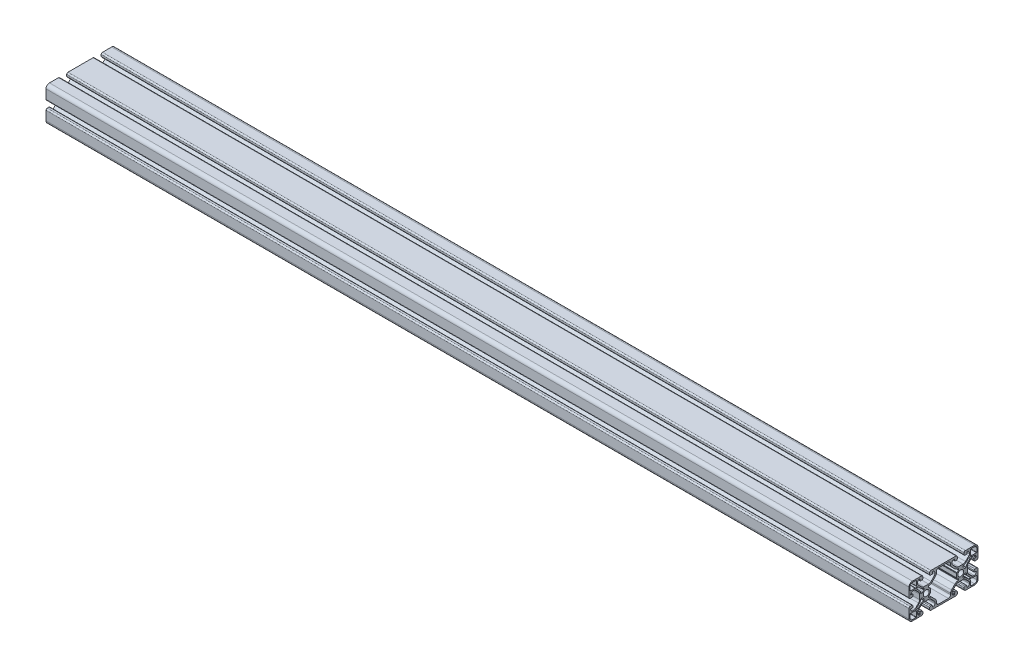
from build123d import *

# Parameters (mm, degrees)
MODEL_R                = 3.4
STRUKTURBAUTEIL1_DEPTH = 1000


with BuildPart() as part:
    # Model → Strukturbauteil1 (new body)
    with BuildSketch(Plane(origin=(0, 0, 0), x_dir=(0, 0, -1), z_dir=(1, 0, 0))):
        with BuildLine():
            Line((-40, -16), (-40, -5.5))
            ThreePointArc((-40, -5.5), (-39.560660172, -4.439339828), (-38.5, -4))
            Line((-38.5, -4), (-36.5, -4))
            ThreePointArc((-36.5, -4), (-35.792893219, -4.292893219), (-35.5, -5))
            Line((-35.5, -5), (-35.5, -6.5))
            ThreePointArc((-35.5, -6.5), (-35.646446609, -6.853553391), (-36, -7))
            Line((-36, -7), (-37.5, -7))
            Line((-37.5, -7), (-37.691341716, -7.038060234))
            Line((-37.691341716, -7.038060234), (-37.853553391, -7.146446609))
            Line((-37.853553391, -7.146446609), (-37.961939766, -7.308658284))
            Line((-37.961939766, -7.308658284), (-38, -7.5))
            ThreePointArc((-38, -7.5), (-37.267766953, -9.267766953), (-35.5, -10))
            Line((-35.5, -10), (-34.222539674, -10))
            ThreePointArc((-34.222539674, -10), (-33.45717281, -9.847759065), (-32.808326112, -9.414213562))
            Line((-32.808326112, -9.414213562), (-28.921572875, -5.527460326))
            ThreePointArc((-28.921572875, -5.527460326), (-28.05448187, -4.22976693), (-27.75, -2.699033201))
            Line((-27.75, -2.699033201), (-27.75, 2.699033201))
            ThreePointArc((-27.75, 2.699033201), (-28.05448187, 4.22976693), (-28.921572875, 5.527460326))
            Line((-28.921572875, 5.527460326), (-32.808326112, 9.414213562))
            ThreePointArc((-32.808326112, 9.414213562), (-33.45717281, 9.847759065), (-34.222539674, 10))
            Line((-34.222539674, 10), (-35.5, 10))
            ThreePointArc((-35.5, 10), (-37.267766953, 9.267766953), (-38, 7.5))
            Line((-38, 7.5), (-37.961939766, 7.308658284))
            Line((-37.961939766, 7.308658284), (-37.853553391, 7.146446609))
            Line((-37.853553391, 7.146446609), (-37.691341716, 7.038060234))
            Line((-37.691341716, 7.038060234), (-37.5, 7))
            Line((-37.5, 7), (-36, 7))
            ThreePointArc((-36, 7), (-35.646446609, 6.853553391), (-35.5, 6.5))
            Line((-35.5, 6.5), (-35.5, 5))
            ThreePointArc((-35.5, 5), (-35.792893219, 4.292893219), (-36.5, 4))
            Line((-36.5, 4), (-38.5, 4))
            ThreePointArc((-38.5, 4), (-39.560660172, 4.439339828), (-40, 5.5))
            Line((-40, 5.5), (-40, 16))
            ThreePointArc((-40, 16), (-38.828427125, 18.828427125), (-36, 20))
            Line((-36, 20), (-25.5, 20))
            ThreePointArc((-25.5, 20), (-24.439339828, 19.560660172), (-24, 18.5))
            Line((-24, 18.5), (-24, 16.5))
            ThreePointArc((-24, 16.5), (-24.292893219, 15.792893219), (-25, 15.5))
            Line((-25, 15.5), (-26.5, 15.5))
            ThreePointArc((-26.5, 15.5), (-26.853553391, 15.646446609), (-27, 16))
            Line((-27, 16), (-27, 17.5))
            Line((-27, 17.5), (-27.038060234, 17.691341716))
            Line((-27.038060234, 17.691341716), (-27.146446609, 17.853553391))
            Line((-27.146446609, 17.853553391), (-27.308658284, 17.961939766))
            Line((-27.308658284, 17.961939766), (-27.5, 18))
            ThreePointArc((-27.5, 18), (-29.267766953, 17.267766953), (-30, 15.5))
            Line((-30, 15.5), (-30, 14.222539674))
            ThreePointArc((-30, 14.222539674), (-29.847759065, 13.45717281), (-29.414213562, 12.808326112))
            Line((-29.414213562, 12.808326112), (-25.527460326, 8.921572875))
            ThreePointArc((-25.527460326, 8.921572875), (-24.22976693, 8.05448187), (-22.699033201, 7.75))
            Line((-22.699033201, 7.75), (-17.300966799, 7.75))
            ThreePointArc((-17.300966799, 7.75), (-15.77023307, 8.05448187), (-14.472539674, 8.921572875))
            Line((-14.472539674, 8.921572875), (-10.585786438, 12.808326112))
            ThreePointArc((-10.585786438, 12.808326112), (-10.152240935, 13.45717281), (-10, 14.222539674))
            Line((-10, 14.222539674), (-10, 15.5))
            ThreePointArc((-10, 15.5), (-10.732233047, 17.267766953), (-12.5, 18))
            Line((-12.5, 18), (-12.691341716, 17.961939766))
            Line((-12.691341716, 17.961939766), (-12.853553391, 17.853553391))
            Line((-12.853553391, 17.853553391), (-12.961939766, 17.691341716))
            Line((-12.961939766, 17.691341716), (-13, 17.5))
            Line((-13, 17.5), (-13, 16))
            ThreePointArc((-13, 16), (-13.146446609, 15.646446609), (-13.5, 15.5))
            Line((-13.5, 15.5), (-15, 15.5))
            ThreePointArc((-15, 15.5), (-15.707106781, 15.792893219), (-16, 16.5))
            Line((-16, 16.5), (-16, 18.5))
            ThreePointArc((-16, 18.5), (-15.560660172, 19.560660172), (-14.5, 20))
            Line((-14.5, 20), (14.5, 20))
            ThreePointArc((14.5, 20), (15.560660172, 19.560660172), (16, 18.5))
            Line((16, 18.5), (16, 16.5))
            ThreePointArc((16, 16.5), (15.707106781, 15.792893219), (15, 15.5))
            Line((15, 15.5), (13.5, 15.5))
            ThreePointArc((13.5, 15.5), (13.146446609, 15.646446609), (13, 16))
            Line((13, 16), (13, 17.5))
            Line((13, 17.5), (12.961939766, 17.691341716))
            Line((12.961939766, 17.691341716), (12.853553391, 17.853553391))
            Line((12.853553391, 17.853553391), (12.691341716, 17.961939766))
            Line((12.691341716, 17.961939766), (12.5, 18))
            ThreePointArc((12.5, 18), (10.732233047, 17.267766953), (10, 15.5))
            Line((10, 15.5), (10, 14.222539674))
            ThreePointArc((10, 14.222539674), (10.152240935, 13.45717281), (10.585786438, 12.808326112))
            Line((10.585786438, 12.808326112), (14.472539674, 8.921572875))
            ThreePointArc((14.472539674, 8.921572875), (15.77023307, 8.05448187), (17.300966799, 7.75))
            Line((17.300966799, 7.75), (22.699033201, 7.75))
            ThreePointArc((22.699033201, 7.75), (24.22976693, 8.05448187), (25.527460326, 8.921572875))
            Line((25.527460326, 8.921572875), (29.414213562, 12.808326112))
            ThreePointArc((29.414213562, 12.808326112), (29.847759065, 13.45717281), (30, 14.222539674))
            Line((30, 14.222539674), (30, 15.5))
            ThreePointArc((30, 15.5), (29.267766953, 17.267766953), (27.5, 18))
            Line((27.5, 18), (27.308658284, 17.961939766))
            Line((27.308658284, 17.961939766), (27.146446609, 17.853553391))
            Line((27.146446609, 17.853553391), (27.038060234, 17.691341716))
            Line((27.038060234, 17.691341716), (27, 17.5))
            Line((27, 17.5), (27, 16))
            ThreePointArc((27, 16), (26.853553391, 15.646446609), (26.5, 15.5))
            Line((26.5, 15.5), (25, 15.5))
            ThreePointArc((25, 15.5), (24.292893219, 15.792893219), (24, 16.5))
            Line((24, 16.5), (24, 18.5))
            ThreePointArc((24, 18.5), (24.439339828, 19.560660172), (25.5, 20))
            Line((25.5, 20), (36, 20))
            ThreePointArc((36, 20), (38.828427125, 18.828427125), (40, 16))
            Line((40, 16), (40, 5.5))
            ThreePointArc((40, 5.5), (39.560660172, 4.439339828), (38.5, 4))
            Line((38.5, 4), (36.5, 4))
            ThreePointArc((36.5, 4), (35.792893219, 4.292893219), (35.5, 5))
            Line((35.5, 5), (35.5, 6.5))
            ThreePointArc((35.5, 6.5), (35.646446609, 6.853553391), (36, 7))
            Line((36, 7), (37.5, 7))
            Line((37.5, 7), (37.691341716, 7.038060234))
            Line((37.691341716, 7.038060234), (37.853553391, 7.146446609))
            Line((37.853553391, 7.146446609), (37.961939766, 7.308658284))
            Line((37.961939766, 7.308658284), (38, 7.5))
            ThreePointArc((38, 7.5), (37.267766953, 9.267766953), (35.5, 10))
            Line((35.5, 10), (34.222539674, 10))
            ThreePointArc((34.222539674, 10), (33.45717281, 9.847759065), (32.808326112, 9.414213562))
            Line((32.808326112, 9.414213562), (28.921572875, 5.527460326))
            ThreePointArc((28.921572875, 5.527460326), (28.05448187, 4.22976693), (27.75, 2.699033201))
            Line((27.75, 2.699033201), (27.75, -2.699033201))
            ThreePointArc((27.75, -2.699033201), (28.05448187, -4.22976693), (28.921572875, -5.527460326))
            Line((28.921572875, -5.527460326), (32.808326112, -9.414213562))
            ThreePointArc((32.808326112, -9.414213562), (33.45717281, -9.847759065), (34.222539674, -10))
            Line((34.222539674, -10), (35.5, -10))
            ThreePointArc((35.5, -10), (37.267766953, -9.267766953), (38, -7.5))
            Line((38, -7.5), (37.961939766, -7.308658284))
            Line((37.961939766, -7.308658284), (37.853553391, -7.146446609))
            Line((37.853553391, -7.146446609), (37.691341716, -7.038060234))
            Line((37.691341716, -7.038060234), (37.5, -7))
            Line((37.5, -7), (36, -7))
            ThreePointArc((36, -7), (35.646446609, -6.853553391), (35.5, -6.5))
            Line((35.5, -6.5), (35.5, -5))
            ThreePointArc((35.5, -5), (35.792893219, -4.292893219), (36.5, -4))
            Line((36.5, -4), (38.5, -4))
            ThreePointArc((38.5, -4), (39.560660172, -4.439339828), (40, -5.5))
            Line((40, -5.5), (40, -16))
            ThreePointArc((40, -16), (38.828427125, -18.828427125), (36, -20))
            Line((36, -20), (25.5, -20))
            ThreePointArc((25.5, -20), (24.439339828, -19.560660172), (24, -18.5))
            Line((24, -18.5), (24, -16.5))
            ThreePointArc((24, -16.5), (24.292893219, -15.792893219), (25, -15.5))
            Line((25, -15.5), (26.5, -15.5))
            ThreePointArc((26.5, -15.5), (26.853553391, -15.646446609), (27, -16))
            Line((27, -16), (27, -17.5))
            Line((27, -17.5), (27.038060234, -17.691341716))
            Line((27.038060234, -17.691341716), (27.146446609, -17.853553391))
            Line((27.146446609, -17.853553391), (27.308658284, -17.961939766))
            Line((27.308658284, -17.961939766), (27.5, -18))
            ThreePointArc((27.5, -18), (29.267766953, -17.267766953), (30, -15.5))
            Line((30, -15.5), (30, -14.222539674))
            ThreePointArc((30, -14.222539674), (29.847759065, -13.45717281), (29.414213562, -12.808326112))
            Line((29.414213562, -12.808326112), (25.527460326, -8.921572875))
            ThreePointArc((25.527460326, -8.921572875), (24.22976693, -8.05448187), (22.699033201, -7.75))
            Line((22.699033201, -7.75), (17.300966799, -7.75))
            ThreePointArc((17.300966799, -7.75), (15.77023307, -8.05448187), (14.472539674, -8.921572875))
            Line((14.472539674, -8.921572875), (10.585786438, -12.808326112))
            ThreePointArc((10.585786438, -12.808326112), (10.152240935, -13.45717281), (10, -14.222539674))
            Line((10, -14.222539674), (10, -15.5))
            ThreePointArc((10, -15.5), (10.732233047, -17.267766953), (12.5, -18))
            Line((12.5, -18), (12.691341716, -17.961939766))
            Line((12.691341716, -17.961939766), (12.853553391, -17.853553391))
            Line((12.853553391, -17.853553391), (12.961939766, -17.691341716))
            Line((12.961939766, -17.691341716), (13, -17.5))
            Line((13, -17.5), (13, -16))
            ThreePointArc((13, -16), (13.146446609, -15.646446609), (13.5, -15.5))
            Line((13.5, -15.5), (15, -15.5))
            ThreePointArc((15, -15.5), (15.707106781, -15.792893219), (16, -16.5))
            Line((16, -16.5), (16, -18.5))
            ThreePointArc((16, -18.5), (15.560660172, -19.560660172), (14.5, -20))
            Line((14.5, -20), (-14.5, -20))
            ThreePointArc((-14.5, -20), (-15.560660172, -19.560660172), (-16, -18.5))
            Line((-16, -18.5), (-16, -16.5))
            ThreePointArc((-16, -16.5), (-15.707106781, -15.792893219), (-15, -15.5))
            Line((-15, -15.5), (-13.5, -15.5))
            ThreePointArc((-13.5, -15.5), (-13.146446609, -15.646446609), (-13, -16))
            Line((-13, -16), (-13, -17.5))
            Line((-13, -17.5), (-12.961939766, -17.691341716))
            Line((-12.961939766, -17.691341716), (-12.853553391, -17.853553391))
            Line((-12.853553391, -17.853553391), (-12.691341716, -17.961939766))
            Line((-12.691341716, -17.961939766), (-12.5, -18))
            ThreePointArc((-12.5, -18), (-10.732233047, -17.267766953), (-10, -15.5))
            Line((-10, -15.5), (-10, -14.222539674))
            ThreePointArc((-10, -14.222539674), (-10.152240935, -13.45717281), (-10.585786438, -12.808326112))
            Line((-10.585786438, -12.808326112), (-14.472539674, -8.921572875))
            ThreePointArc((-14.472539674, -8.921572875), (-15.77023307, -8.05448187), (-17.300966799, -7.75))
            Line((-17.300966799, -7.75), (-22.699033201, -7.75))
            ThreePointArc((-22.699033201, -7.75), (-24.22976693, -8.05448187), (-25.527460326, -8.921572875))
            Line((-25.527460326, -8.921572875), (-29.414213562, -12.808326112))
            ThreePointArc((-29.414213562, -12.808326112), (-29.847759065, -13.45717281), (-30, -14.222539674))
            Line((-30, -14.222539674), (-30, -15.5))
            ThreePointArc((-30, -15.5), (-29.267766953, -17.267766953), (-27.5, -18))
            Line((-27.5, -18), (-27.308658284, -17.961939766))
            Line((-27.308658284, -17.961939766), (-27.146446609, -17.853553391))
            Line((-27.146446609, -17.853553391), (-27.038060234, -17.691341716))
            Line((-27.038060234, -17.691341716), (-27, -17.5))
            Line((-27, -17.5), (-27, -16))
            ThreePointArc((-27, -16), (-26.853553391, -15.646446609), (-26.5, -15.5))
            Line((-26.5, -15.5), (-25, -15.5))
            ThreePointArc((-25, -15.5), (-24.292893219, -15.792893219), (-24, -16.5))
            Line((-24, -16.5), (-24, -18.5))
            ThreePointArc((-24, -18.5), (-24.439339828, -19.560660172), (-25.5, -20))
            Line((-25.5, -20), (-36, -20))
            ThreePointArc((-36, -20), (-38.828427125, -18.828427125), (-40, -16))
        make_face()
        with Locations((-20, 0)):
            Circle(MODEL_R, mode=Mode.SUBTRACT)
        with Locations((20, 0)):
            Circle(MODEL_R, mode=Mode.SUBTRACT)
        with BuildLine():
            Line((-30.748023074, 9.333809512), (-27.931623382, 6.517409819))
            ThreePointArc((-27.931623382, 6.517409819), (-26.779549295, 4.809630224), (-26.350847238, 2.794685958))
            Line((-26.350847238, 2.794685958), (-26.326508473, 2.681522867))
            Line((-26.326508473, 2.681522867), (-26.261139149, 2.585997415))
            Line((-26.261139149, 2.585997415), (-26.164470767, 2.522330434))
            Line((-26.164470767, 2.522330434), (-26.050894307, 2.5))
            Line((-26.050894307, 2.5), (-24.5, 2.5))
            ThreePointArc((-24.5, 2.5), (-24.354307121, 2.537752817), (-24.245283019, 2.641509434))
            Line((-24.245283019, 2.641509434), (-23.535533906, 3.535533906))
            Line((-23.535533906, 3.535533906), (-22.641509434, 4.245283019))
            ThreePointArc((-22.641509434, 4.245283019), (-22.537752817, 4.354307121), (-22.5, 4.5))
            Line((-22.5, 4.5), (-22.5, 6.050894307))
            Line((-22.5, 6.050894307), (-22.522330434, 6.164470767))
            Line((-22.522330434, 6.164470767), (-22.585997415, 6.261139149))
            Line((-22.585997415, 6.261139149), (-22.681522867, 6.326508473))
            Line((-22.681522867, 6.326508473), (-22.794685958, 6.350847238))
            ThreePointArc((-22.794685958, 6.350847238), (-24.809630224, 6.779549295), (-26.517409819, 7.931623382))
            Line((-26.517409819, 7.931623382), (-29.333809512, 10.748023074))
            ThreePointArc((-29.333809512, 10.748023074), (-29.545941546, 10.83589104), (-29.75807358, 10.748023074))
            Line((-29.75807358, 10.748023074), (-30.748023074, 9.75807358))
            ThreePointArc((-30.748023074, 9.75807358), (-30.83589104, 9.545941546), (-30.748023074, 9.333809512))
        make_face(mode=Mode.SUBTRACT)
        with BuildLine():
            Line((-31.4, 12.938477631), (-31.4, 18.3))
            ThreePointArc((-31.4, 18.3), (-31.487867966, 18.512132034), (-31.7, 18.6))
            Line((-31.7, 18.6), (-36, 18.6))
            ThreePointArc((-36, 18.6), (-37.838477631, 17.838477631), (-38.6, 16))
            Line((-38.6, 16), (-38.6, 11.7))
            ThreePointArc((-38.6, 11.7), (-38.512132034, 11.487867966), (-38.3, 11.4))
            Line((-38.3, 11.4), (-32.938477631, 11.4))
            ThreePointArc((-32.938477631, 11.4), (-32.823672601, 11.37716386), (-32.726345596, 11.312132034))
            Line((-32.726345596, 11.312132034), (-32.162236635, 10.748023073))
            ThreePointArc((-32.162236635, 10.748023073), (-31.950104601, 10.660155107), (-31.737972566, 10.748023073))
            Line((-31.737972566, 10.748023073), (-30.748023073, 11.737972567))
            ThreePointArc((-30.748023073, 11.737972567), (-30.660155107, 11.950104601), (-30.748023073, 12.162236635))
            Line((-30.748023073, 12.162236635), (-31.312132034, 12.726345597))
            ThreePointArc((-31.312132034, 12.726345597), (-31.37716386, 12.823672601), (-31.4, 12.938477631))
        make_face(mode=Mode.SUBTRACT)
        with BuildLine():
            Line((-8.2, -15.7), (-8.2, -14.222539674))
            ThreePointArc((-8.2, -14.222539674), (-8.489257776, -12.768342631), (-9.312994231, -11.535533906))
            Line((-9.312994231, -11.535533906), (-13.199747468, -7.648780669))
            ThreePointArc((-13.199747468, -7.648780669), (-15.037130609, -6.410051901), (-17.20496558, -5.950794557))
            Line((-17.20496558, -5.950794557), (-17.31823695, -5.926552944))
            Line((-17.31823695, -5.926552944), (-17.413880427, -5.861204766))
            Line((-17.413880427, -5.861204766), (-17.477636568, -5.764492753))
            Line((-17.477636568, -5.764492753), (-17.5, -5.650835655))
            Line((-17.5, -5.650835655), (-17.5, -4.5))
            ThreePointArc((-17.5, -4.5), (-17.462247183, -4.354307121), (-17.358490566, -4.245283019))
            Line((-17.358490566, -4.245283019), (-16.464466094, -3.535533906))
            Line((-16.464466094, -3.535533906), (-15.754716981, -2.641509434))
            ThreePointArc((-15.754716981, -2.641509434), (-15.645692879, -2.537752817), (-15.5, -2.5))
            Line((-15.5, -2.5), (-15.3, -2.5))
            ThreePointArc((-15.3, -2.5), (-15.087867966, -2.412132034), (-15, -2.2))
            Line((-15, -2.2), (-15, 2.2))
            ThreePointArc((-15, 2.2), (-15.087867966, 2.412132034), (-15.3, 2.5))
            Line((-15.3, 2.5), (-15.5, 2.5))
            ThreePointArc((-15.5, 2.5), (-15.645692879, 2.537752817), (-15.754716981, 2.641509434))
            Line((-15.754716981, 2.641509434), (-16.464466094, 3.535533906))
            Line((-16.464466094, 3.535533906), (-17.358490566, 4.245283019))
            ThreePointArc((-17.358490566, 4.245283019), (-17.462247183, 4.354307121), (-17.5, 4.5))
            Line((-17.5, 4.5), (-17.5, 5.650835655))
            Line((-17.5, 5.650835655), (-17.477636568, 5.764492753))
            Line((-17.477636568, 5.764492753), (-17.413880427, 5.861204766))
            Line((-17.413880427, 5.861204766), (-17.31823695, 5.926552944))
            Line((-17.31823695, 5.926552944), (-17.20496558, 5.950794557))
            ThreePointArc((-17.20496558, 5.950794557), (-15.037130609, 6.410051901), (-13.199747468, 7.648780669))
            Line((-13.199747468, 7.648780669), (-9.312994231, 11.535533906))
            ThreePointArc((-9.312994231, 11.535533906), (-8.489257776, 12.768342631), (-8.2, 14.222539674))
            Line((-8.2, 14.222539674), (-8.2, 15.7))
            ThreePointArc((-8.2, 15.7), (-7.467766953, 17.467766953), (-5.7, 18.2))
            Line((-5.7, 18.2), (5.7, 18.2))
            ThreePointArc((5.7, 18.2), (7.467766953, 17.467766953), (8.2, 15.7))
            Line((8.2, 15.7), (8.2, 14.222539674))
            ThreePointArc((8.2, 14.222539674), (8.489257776, 12.768342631), (9.312994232, 11.535533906))
            Line((9.312994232, 11.535533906), (13.199747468, 7.648780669))
            ThreePointArc((13.199747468, 7.648780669), (15.037130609, 6.410051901), (17.20496558, 5.950794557))
            Line((17.20496558, 5.950794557), (17.31823695, 5.926552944))
            Line((17.31823695, 5.926552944), (17.413880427, 5.861204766))
            Line((17.413880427, 5.861204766), (17.477636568, 5.764492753))
            Line((17.477636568, 5.764492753), (17.5, 5.650835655))
            Line((17.5, 5.650835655), (17.5, 4.5))
            ThreePointArc((17.5, 4.5), (17.462247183, 4.354307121), (17.358490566, 4.245283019))
            ThreePointArc((17.358490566, 4.245283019), (16.464466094, 3.535533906), (15.754716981, 2.641509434))
            ThreePointArc((15.754716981, 2.641509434), (15.645692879, 2.537752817), (15.5, 2.5))
            Line((15.5, 2.5), (15.3, 2.5))
            ThreePointArc((15.3, 2.5), (15.087867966, 2.412132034), (15, 2.2))
            Line((15, 2.2), (15, -2.2))
            ThreePointArc((15, -2.2), (15.087867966, -2.412132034), (15.3, -2.5))
            Line((15.3, -2.5), (15.5, -2.5))
            ThreePointArc((15.5, -2.5), (15.645692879, -2.537752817), (15.754716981, -2.641509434))
            ThreePointArc((15.754716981, -2.641509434), (16.464466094, -3.535533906), (17.358490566, -4.245283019))
            ThreePointArc((17.358490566, -4.245283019), (17.462247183, -4.354307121), (17.5, -4.5))
            Line((17.5, -4.5), (17.5, -5.650835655))
            Line((17.5, -5.650835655), (17.477636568, -5.764492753))
            Line((17.477636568, -5.764492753), (17.413880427, -5.861204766))
            Line((17.413880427, -5.861204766), (17.31823695, -5.926552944))
            Line((17.31823695, -5.926552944), (17.20496558, -5.950794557))
            ThreePointArc((17.20496558, -5.950794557), (15.037130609, -6.410051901), (13.199747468, -7.648780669))
            Line((13.199747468, -7.648780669), (9.312994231, -11.535533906))
            ThreePointArc((9.312994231, -11.535533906), (8.489257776, -12.768342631), (8.2, -14.222539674))
            Line((8.2, -14.222539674), (8.2, -15.7))
            ThreePointArc((8.2, -15.7), (7.467766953, -17.467766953), (5.7, -18.2))
            Line((5.7, -18.2), (-5.7, -18.2))
            ThreePointArc((-5.7, -18.2), (-7.467766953, -17.467766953), (-8.2, -15.7))
        make_face(mode=Mode.SUBTRACT)
        with BuildLine():
            Line((-22.5, -6.050894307), (-22.5, -4.5))
            ThreePointArc((-22.5, -4.5), (-22.537752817, -4.354307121), (-22.641509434, -4.245283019))
            Line((-22.641509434, -4.245283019), (-23.535533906, -3.535533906))
            Line((-23.535533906, -3.535533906), (-24.245283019, -2.641509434))
            ThreePointArc((-24.245283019, -2.641509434), (-24.354307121, -2.537752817), (-24.5, -2.5))
            Line((-24.5, -2.5), (-26.050894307, -2.5))
            Line((-26.050894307, -2.5), (-26.164470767, -2.522330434))
            Line((-26.164470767, -2.522330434), (-26.261139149, -2.585997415))
            Line((-26.261139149, -2.585997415), (-26.326508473, -2.681522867))
            Line((-26.326508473, -2.681522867), (-26.350847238, -2.794685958))
            ThreePointArc((-26.350847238, -2.794685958), (-26.779549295, -4.809630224), (-27.931623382, -6.517409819))
            Line((-27.931623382, -6.517409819), (-30.748023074, -9.333809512))
            ThreePointArc((-30.748023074, -9.333809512), (-30.83589104, -9.545941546), (-30.748023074, -9.75807358))
            Line((-30.748023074, -9.75807358), (-29.75807358, -10.748023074))
            ThreePointArc((-29.75807358, -10.748023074), (-29.545941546, -10.83589104), (-29.333809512, -10.748023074))
            Line((-29.333809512, -10.748023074), (-26.517409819, -7.931623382))
            ThreePointArc((-26.517409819, -7.931623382), (-24.809630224, -6.779549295), (-22.794685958, -6.350847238))
            Line((-22.794685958, -6.350847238), (-22.681522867, -6.326508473))
            Line((-22.681522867, -6.326508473), (-22.585997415, -6.261139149))
            Line((-22.585997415, -6.261139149), (-22.522330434, -6.164470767))
            Line((-22.522330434, -6.164470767), (-22.5, -6.050894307))
        make_face(mode=Mode.SUBTRACT)
        with BuildLine():
            Line((-31.4, -12.938477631), (-31.4, -18.3))
            ThreePointArc((-31.4, -18.3), (-31.487867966, -18.512132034), (-31.7, -18.6))
            Line((-31.7, -18.6), (-36, -18.6))
            ThreePointArc((-36, -18.6), (-37.838477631, -17.838477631), (-38.6, -16))
            Line((-38.6, -16), (-38.6, -11.7))
            ThreePointArc((-38.6, -11.7), (-38.512132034, -11.487867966), (-38.3, -11.4))
            Line((-38.3, -11.4), (-32.938477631, -11.4))
            ThreePointArc((-32.938477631, -11.4), (-32.823672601, -11.37716386), (-32.726345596, -11.312132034))
            Line((-32.726345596, -11.312132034), (-32.162236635, -10.748023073))
            ThreePointArc((-32.162236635, -10.748023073), (-31.950104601, -10.660155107), (-31.737972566, -10.748023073))
            Line((-31.737972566, -10.748023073), (-30.748023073, -11.737972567))
            ThreePointArc((-30.748023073, -11.737972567), (-30.660155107, -11.950104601), (-30.748023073, -12.162236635))
            Line((-30.748023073, -12.162236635), (-31.312132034, -12.726345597))
            ThreePointArc((-31.312132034, -12.726345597), (-31.37716386, -12.823672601), (-31.4, -12.938477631))
        make_face(mode=Mode.SUBTRACT)
        with BuildLine():
            Line((32.938477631, 11.400000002), (38.3, 11.400000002))
            ThreePointArc((38.3, 11.400000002), (38.512132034, 11.487867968), (38.6, 11.700000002))
            Line((38.6, 11.700000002), (38.6, 16))
            ThreePointArc((38.6, 16), (37.838477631, 17.838477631), (36, 18.6))
            Line((36, 18.6), (31.7, 18.6))
            ThreePointArc((31.7, 18.6), (31.487867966, 18.512132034), (31.4, 18.3))
            Line((31.4, 18.3), (31.4, 12.938477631))
            ThreePointArc((31.4, 12.938477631), (31.37716386, 12.823672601), (31.312132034, 12.726345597))
            Line((31.312132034, 12.726345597), (30.748023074, 12.162236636))
            ThreePointArc((30.748023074, 12.162236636), (30.660155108, 11.950104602), (30.748023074, 11.737972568))
            Line((30.748023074, 11.737972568), (31.737972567, 10.748023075))
            ThreePointArc((31.737972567, 10.748023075), (31.950104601, 10.660155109), (32.162236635, 10.748023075))
            Line((32.162236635, 10.748023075), (32.726345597, 11.312132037))
            ThreePointArc((32.726345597, 11.312132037), (32.823672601, 11.377163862), (32.938477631, 11.400000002))
        make_face(mode=Mode.SUBTRACT)
        with BuildLine():
            Line((22.5, 4.5), (22.5, 6.050894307))
            Line((22.5, 6.050894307), (22.522330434, 6.164470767))
            Line((22.522330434, 6.164470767), (22.585997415, 6.261139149))
            Line((22.585997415, 6.261139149), (22.681522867, 6.326508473))
            Line((22.681522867, 6.326508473), (22.794685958, 6.350847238))
            ThreePointArc((22.794685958, 6.350847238), (24.809630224, 6.779549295), (26.517409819, 7.931623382))
            Line((26.517409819, 7.931623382), (29.333809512, 10.748023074))
            ThreePointArc((29.333809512, 10.748023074), (29.545941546, 10.83589104), (29.75807358, 10.748023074))
            Line((29.75807358, 10.748023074), (30.748023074, 9.75807358))
            ThreePointArc((30.748023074, 9.75807358), (30.83589104, 9.545941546), (30.748023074, 9.333809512))
            Line((30.748023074, 9.333809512), (27.931623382, 6.517409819))
            ThreePointArc((27.931623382, 6.517409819), (26.779549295, 4.809630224), (26.350847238, 2.794685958))
            Line((26.350847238, 2.794685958), (26.326508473, 2.681522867))
            Line((26.326508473, 2.681522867), (26.261139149, 2.585997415))
            Line((26.261139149, 2.585997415), (26.164470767, 2.522330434))
            Line((26.164470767, 2.522330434), (26.050894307, 2.5))
            Line((26.050894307, 2.5), (24.5, 2.5))
            ThreePointArc((24.5, 2.5), (24.354307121, 2.537752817), (24.245283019, 2.641509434))
            Line((24.245283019, 2.641509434), (23.535533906, 3.535533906))
            Line((23.535533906, 3.535533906), (22.641509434, 4.245283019))
            ThreePointArc((22.641509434, 4.245283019), (22.537752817, 4.354307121), (22.5, 4.5))
        make_face(mode=Mode.SUBTRACT)
        with BuildLine():
            Line((31.4, -12.938477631), (31.4, -18.3))
            ThreePointArc((31.4, -18.3), (31.487867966, -18.512132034), (31.7, -18.6))
            Line((31.7, -18.6), (36, -18.6))
            ThreePointArc((36, -18.6), (37.838477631, -17.838477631), (38.6, -16))
            Line((38.6, -16), (38.6, -11.700000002))
            ThreePointArc((38.6, -11.700000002), (38.512132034, -11.487867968), (38.3, -11.400000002))
            Line((38.3, -11.400000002), (32.938477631, -11.400000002))
            ThreePointArc((32.938477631, -11.400000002), (32.823672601, -11.377163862), (32.726345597, -11.312132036))
            Line((32.726345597, -11.312132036), (32.162236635, -10.748023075))
            ThreePointArc((32.162236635, -10.748023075), (31.950104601, -10.660155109), (31.737972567, -10.748023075))
            Line((31.737972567, -10.748023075), (30.748023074, -11.737972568))
            ThreePointArc((30.748023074, -11.737972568), (30.660155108, -11.950104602), (30.748023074, -12.162236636))
            Line((30.748023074, -12.162236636), (31.312132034, -12.726345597))
            ThreePointArc((31.312132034, -12.726345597), (31.37716386, -12.823672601), (31.4, -12.938477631))
        make_face(mode=Mode.SUBTRACT)
        with BuildLine():
            Line((22.5, -4.5), (22.5, -6.050894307))
            Line((22.5, -6.050894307), (22.522330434, -6.164470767))
            Line((22.522330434, -6.164470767), (22.585997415, -6.261139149))
            Line((22.585997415, -6.261139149), (22.681522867, -6.326508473))
            Line((22.681522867, -6.326508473), (22.794685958, -6.350847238))
            ThreePointArc((22.794685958, -6.350847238), (24.809630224, -6.779549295), (26.517409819, -7.931623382))
            Line((26.517409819, -7.931623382), (29.333809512, -10.748023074))
            ThreePointArc((29.333809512, -10.748023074), (29.545941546, -10.83589104), (29.75807358, -10.748023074))
            Line((29.75807358, -10.748023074), (30.748023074, -9.75807358))
            ThreePointArc((30.748023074, -9.75807358), (30.83589104, -9.545941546), (30.748023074, -9.333809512))
            Line((30.748023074, -9.333809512), (27.931623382, -6.517409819))
            ThreePointArc((27.931623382, -6.517409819), (26.779549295, -4.809630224), (26.350847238, -2.794685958))
            Line((26.350847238, -2.794685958), (26.326508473, -2.681522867))
            Line((26.326508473, -2.681522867), (26.261139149, -2.585997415))
            Line((26.261139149, -2.585997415), (26.164470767, -2.522330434))
            Line((26.164470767, -2.522330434), (26.050894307, -2.5))
            Line((26.050894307, -2.5), (24.5, -2.5))
            ThreePointArc((24.5, -2.5), (24.354307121, -2.537752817), (24.245283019, -2.641509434))
            Line((24.245283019, -2.641509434), (23.535533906, -3.535533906))
            Line((23.535533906, -3.535533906), (22.641509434, -4.245283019))
            ThreePointArc((22.641509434, -4.245283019), (22.537752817, -4.354307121), (22.5, -4.5))
        make_face(mode=Mode.SUBTRACT)
    extrude(amount=STRUKTURBAUTEIL1_DEPTH)


solid = part.part
